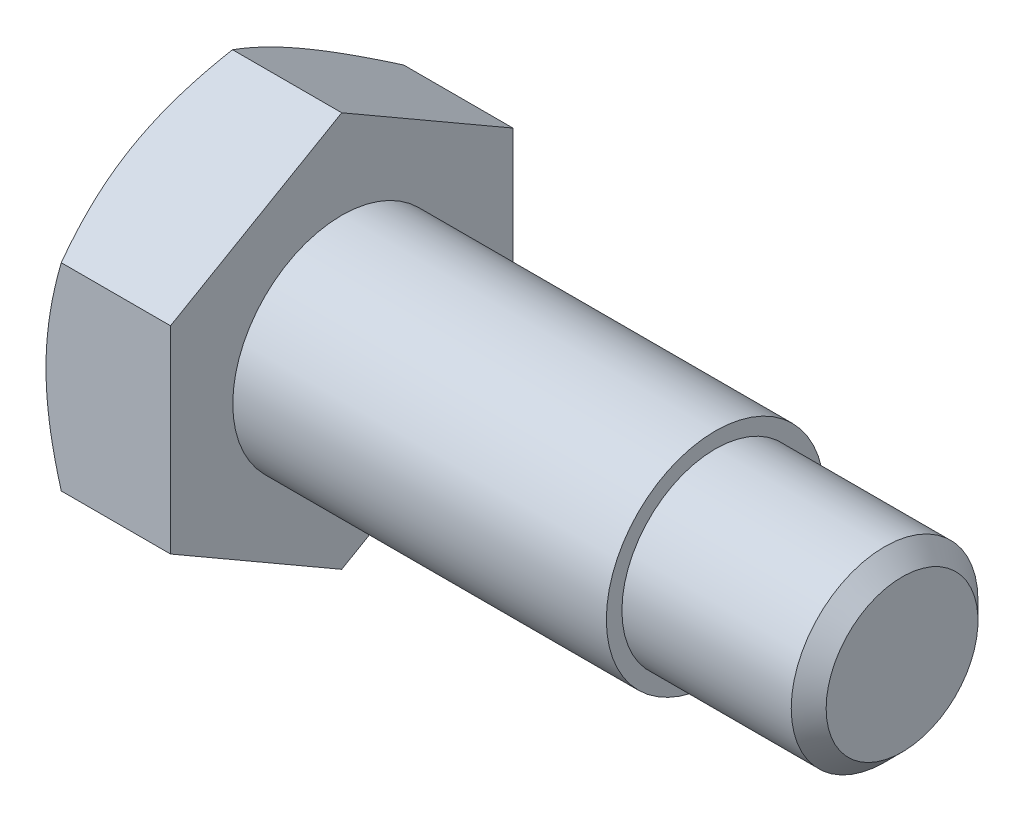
ISO-10303-21;
HEADER;
FILE_DESCRIPTION(('STEP AP214'),'2;1');
FILE_NAME('part.step','',(''),(''),'','','');
FILE_SCHEMA(('AUTOMOTIVE_DESIGN { 1 0 10303 214 1 1 1 1 }'));
ENDSEC;
DATA;
#1=APPLICATION_CONTEXT('core data for automotive mechanical design processes');
#2=APPLICATION_PROTOCOL_DEFINITION('international standard','automotive_design',2000,#1);
#3=PRODUCT_CONTEXT('',#1,'mechanical');
#4=PRODUCT('Part','Part','',(#3));
#5=PRODUCT_RELATED_PRODUCT_CATEGORY('part','',(#4));
#6=PRODUCT_DEFINITION_FORMATION('','',#4);
#7=PRODUCT_DEFINITION_CONTEXT('part definition',#1,'design');
#8=PRODUCT_DEFINITION('design','',#6,#7);
#9=PRODUCT_DEFINITION_SHAPE('','',#8);
#10=(LENGTH_UNIT() NAMED_UNIT(*) SI_UNIT(.MILLI.,.METRE.));
#11=(NAMED_UNIT(*) PLANE_ANGLE_UNIT() SI_UNIT($,.RADIAN.));
#12=(NAMED_UNIT(*) SI_UNIT($,.STERADIAN.) SOLID_ANGLE_UNIT());
#13=UNCERTAINTY_MEASURE_WITH_UNIT(LENGTH_MEASURE(1.E-05),#10,'distance_accuracy_value','');
#14=(GEOMETRIC_REPRESENTATION_CONTEXT(3) GLOBAL_UNCERTAINTY_ASSIGNED_CONTEXT((#13)) GLOBAL_UNIT_ASSIGNED_CONTEXT((#10,
#11,#12)) REPRESENTATION_CONTEXT('',''));
#15=CARTESIAN_POINT('',(0.,0.,0.));
#16=DIRECTION('',(0.,0.,1.));
#17=DIRECTION('',(1.,0.,0.));
#18=AXIS2_PLACEMENT_3D('',#15,#16,#17);
#19=CARTESIAN_POINT('',(2.,3.17542648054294,0.));
#20=DIRECTION('',(1.,0.,0.));
#21=DIRECTION('',(0.,0.,-1.));
#22=AXIS2_PLACEMENT_3D('',#19,#20,#21);
#23=PLANE('',#22);
#24=DIRECTION('',(0.,0.500000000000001,0.866025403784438));
#25=VECTOR('',#24,1.);
#26=CARTESIAN_POINT('',(2.,1.58771324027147,-2.75));
#27=LINE('',#26,#25);
#28=CARTESIAN_POINT('',(2.,1.58771324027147,-2.75));
#29=VERTEX_POINT('',#28);
#30=CARTESIAN_POINT('',(2.,3.17542648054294,0.));
#31=VERTEX_POINT('',#30);
#32=EDGE_CURVE('E235',#29,#31,#27,.T.);
#33=ORIENTED_EDGE('',*,*,#32,.T.);
#34=DIRECTION('',(0.,-0.500000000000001,0.866025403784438));
#35=VECTOR('',#34,1.);
#36=CARTESIAN_POINT('',(2.,3.17542648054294,0.));
#37=LINE('',#36,#35);
#38=CARTESIAN_POINT('',(2.,1.58771324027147,2.75));
#39=VERTEX_POINT('',#38);
#40=EDGE_CURVE('E233',#31,#39,#37,.T.);
#41=ORIENTED_EDGE('',*,*,#40,.T.);
#42=DIRECTION('',(0.,-1.,0.));
#43=VECTOR('',#42,1.);
#44=CARTESIAN_POINT('',(2.,1.58771324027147,2.75));
#45=LINE('',#44,#43);
#46=CARTESIAN_POINT('',(2.,-1.58771324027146,2.75));
#47=VERTEX_POINT('',#46);
#48=EDGE_CURVE('E229',#39,#47,#45,.T.);
#49=ORIENTED_EDGE('',*,*,#48,.T.);
#50=DIRECTION('',(0.,-0.500000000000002,-0.866025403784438));
#51=VECTOR('',#50,1.);
#52=CARTESIAN_POINT('',(2.,-3.17542648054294,0.));
#53=LINE('',#52,#51);
#54=CARTESIAN_POINT('',(2.,-3.17542648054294,0.));
#55=VERTEX_POINT('',#54);
#56=EDGE_CURVE('E227',#47,#55,#53,.T.);
#57=ORIENTED_EDGE('',*,*,#56,.T.);
#58=DIRECTION('',(0.,0.499999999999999,-0.866025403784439));
#59=VECTOR('',#58,1.);
#60=CARTESIAN_POINT('',(2.,-1.58771324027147,-2.75));
#61=LINE('',#60,#59);
#62=CARTESIAN_POINT('',(2.,-1.58771324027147,-2.75));
#63=VERTEX_POINT('',#62);
#64=EDGE_CURVE('E225',#55,#63,#61,.T.);
#65=ORIENTED_EDGE('',*,*,#64,.T.);
#66=DIRECTION('',(0.,1.,0.));
#67=VECTOR('',#66,1.);
#68=CARTESIAN_POINT('',(2.,1.58771324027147,-2.75));
#69=LINE('',#68,#67);
#70=EDGE_CURVE('E132',#63,#29,#69,.T.);
#71=ORIENTED_EDGE('',*,*,#70,.T.);
#72=EDGE_LOOP('',(#33,#41,#49,#57,#65,#71));
#73=FACE_BOUND('',#72,.T.);
#74=CARTESIAN_POINT('',(2.,0.,0.));
#75=DIRECTION('',(1.,0.,0.));
#76=DIRECTION('',(0.,0.,-1.));
#77=AXIS2_PLACEMENT_3D('',#74,#75,#76);
#78=CIRCLE('',#77,1.75);
#79=CARTESIAN_POINT('',(2.,0.,-1.75));
#80=VERTEX_POINT('',#79);
#81=EDGE_CURVE('E407',#80,#80,#78,.T.);
#82=ORIENTED_EDGE('',*,*,#81,.F.);
#83=EDGE_LOOP('',(#82));
#84=FACE_BOUND('',#83,.T.);
#85=ADVANCED_FACE('F32',(#73,#84),#23,.T.);
#86=CARTESIAN_POINT('',(2.,1.58771324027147,-2.75));
#87=DIRECTION('',(0.,-0.866025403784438,0.500000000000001));
#88=DIRECTION('',(0.,-0.500000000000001,-0.866025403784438));
#89=AXIS2_PLACEMENT_3D('',#86,#87,#88);
#90=PLANE('',#89);
#91=CARTESIAN_POINT('',(0.245686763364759,3.17554195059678,0.0002));
#92=CARTESIAN_POINT('',(0.205387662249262,3.10576962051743,-0.120649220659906));
#93=CARTESIAN_POINT('',(0.168736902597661,3.03539502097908,-0.242541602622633));
#94=CARTESIAN_POINT('',(0.104762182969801,2.89342717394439,-0.488437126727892));
#95=CARTESIAN_POINT('',(0.0774608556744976,2.82183140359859,-0.612444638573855));
#96=CARTESIAN_POINT('',(0.0349617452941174,2.67952717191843,-0.858922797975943));
#97=CARTESIAN_POINT('',(0.0194811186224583,2.60884060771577,-0.981355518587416));
#98=CARTESIAN_POINT('',(0.000999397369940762,2.46713482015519,-1.22679714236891));
#99=CARTESIAN_POINT('',(-0.00201700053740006,2.39611611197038,-1.34980515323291));
#100=CARTESIAN_POINT('',(0.00425314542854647,2.26341005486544,-1.57965878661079));
#101=CARTESIAN_POINT('',(0.0120001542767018,2.20170285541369,-1.68653879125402));
#102=CARTESIAN_POINT('',(0.0365551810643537,2.07869048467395,-1.89960246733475));
#103=CARTESIAN_POINT('',(0.0533715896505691,2.01738573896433,-2.00578540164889));
#104=CARTESIAN_POINT('',(0.0954119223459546,1.89411967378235,-2.21928848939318));
#105=CARTESIAN_POINT('',(0.120814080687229,1.83217395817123,-2.32658161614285));
#106=CARTESIAN_POINT('',(0.178467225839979,1.70920651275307,-2.53956747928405));
#107=CARTESIAN_POINT('',(0.210704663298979,1.64818320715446,-2.64526294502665));
#108=CARTESIAN_POINT('',(0.245686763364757,1.58759777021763,-2.7502));
#109=B_SPLINE_CURVE_WITH_KNOTS('',3,(#91,#92,#93,#94,#95,#96,#97,#98,#99,#100,#101,#102,#103,
#104,#105,#106,#107,#108),.UNSPECIFIED.,.F.,.F.,(4,2,2,2,2,2,2,2,4),(0.,0.435912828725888,
0.872873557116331,1.29901931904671,1.72464171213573,2.09526089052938,2.46622354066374,
2.84541551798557,3.22386274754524),.UNSPECIFIED.);
#110=CARTESIAN_POINT('',(0.245620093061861,3.17542648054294,0.));
#111=VERTEX_POINT('',#110);
#112=CARTESIAN_POINT('',(0.,2.3815698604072,-1.375));
#113=VERTEX_POINT('',#112);
#114=EDGE_CURVE('E50',#111,#113,#109,.T.);
#115=ORIENTED_EDGE('',*,*,#114,.F.);
#116=DIRECTION('',(-1.,0.,0.));
#117=VECTOR('',#116,1.);
#118=CARTESIAN_POINT('',(2.,3.17542648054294,0.));
#119=LINE('',#118,#117);
#120=EDGE_CURVE('E147',#31,#111,#119,.T.);
#121=ORIENTED_EDGE('',*,*,#120,.F.);
#122=ORIENTED_EDGE('',*,*,#32,.F.);
#123=DIRECTION('',(-1.,0.,0.));
#124=VECTOR('',#123,1.);
#125=CARTESIAN_POINT('',(2.,1.58771324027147,-2.75));
#126=LINE('',#125,#124);
#127=CARTESIAN_POINT('',(0.245620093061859,1.58771324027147,-2.75));
#128=VERTEX_POINT('',#127);
#129=EDGE_CURVE('E134',#29,#128,#126,.T.);
#130=ORIENTED_EDGE('',*,*,#129,.T.);
#131=EDGE_CURVE('E128',#113,#128,#109,.T.);
#132=ORIENTED_EDGE('',*,*,#131,.F.);
#133=EDGE_LOOP('',(#115,#121,#122,#130,#132));
#134=FACE_BOUND('',#133,.T.);
#135=ADVANCED_FACE('F34',(#134),#90,.F.);
#136=CARTESIAN_POINT('',(2.,3.17542648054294,0.));
#137=DIRECTION('',(0.,-0.866025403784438,-0.500000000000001));
#138=DIRECTION('',(0.,0.500000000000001,-0.866025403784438));
#139=AXIS2_PLACEMENT_3D('',#136,#137,#138);
#140=PLANE('',#139);
#141=CARTESIAN_POINT('',(0.245686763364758,1.58759777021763,2.7502));
#142=CARTESIAN_POINT('',(0.205387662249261,1.65737010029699,2.62935077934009));
#143=CARTESIAN_POINT('',(0.16873690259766,1.72774469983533,2.50745839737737));
#144=CARTESIAN_POINT('',(0.1047621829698,1.86971254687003,2.26156287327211));
#145=CARTESIAN_POINT('',(0.077460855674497,1.94130831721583,2.13755536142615));
#146=CARTESIAN_POINT('',(0.0349617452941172,2.08361254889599,1.89107720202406));
#147=CARTESIAN_POINT('',(0.0194811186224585,2.15429911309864,1.76864448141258));
#148=CARTESIAN_POINT('',(0.000999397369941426,2.29600490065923,1.52320285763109));
#149=CARTESIAN_POINT('',(-0.00201700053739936,2.36702360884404,1.40019484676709));
#150=CARTESIAN_POINT('',(0.00425314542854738,2.49972966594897,1.17034121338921));
#151=CARTESIAN_POINT('',(0.0120001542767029,2.56143686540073,1.06346120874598));
#152=CARTESIAN_POINT('',(0.0365551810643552,2.68444923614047,0.850397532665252));
#153=CARTESIAN_POINT('',(0.0533715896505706,2.74575398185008,0.744214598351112));
#154=CARTESIAN_POINT('',(0.0954119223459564,2.86902004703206,0.530711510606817));
#155=CARTESIAN_POINT('',(0.120814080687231,2.93096576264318,0.423418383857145));
#156=CARTESIAN_POINT('',(0.178467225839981,3.05393320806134,0.210432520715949));
#157=CARTESIAN_POINT('',(0.210704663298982,3.11495651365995,0.104737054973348));
#158=CARTESIAN_POINT('',(0.245686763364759,3.17554195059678,-0.000199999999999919));
#159=B_SPLINE_CURVE_WITH_KNOTS('',3,(#141,#142,#143,#144,#145,#146,#147,#148,#149,#150,#151,
#152,#153,#154,#155,#156,#157,#158),.UNSPECIFIED.,.F.,.F.,(4,2,2,2,2,2,2,2,4),(0.,
0.435912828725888,0.872873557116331,1.29901931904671,1.72464171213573,2.09526089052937,
2.46622354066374,2.84541551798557,3.22386274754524),.UNSPECIFIED.);
#160=CARTESIAN_POINT('',(0.24562009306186,1.58771324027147,2.75));
#161=VERTEX_POINT('',#160);
#162=CARTESIAN_POINT('',(0.,2.3815698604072,1.375));
#163=VERTEX_POINT('',#162);
#164=EDGE_CURVE('E57',#161,#163,#159,.T.);
#165=ORIENTED_EDGE('',*,*,#164,.F.);
#166=DIRECTION('',(-1.,0.,0.));
#167=VECTOR('',#166,1.);
#168=CARTESIAN_POINT('',(2.,1.58771324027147,2.75));
#169=LINE('',#168,#167);
#170=EDGE_CURVE('E144',#39,#161,#169,.T.);
#171=ORIENTED_EDGE('',*,*,#170,.F.);
#172=ORIENTED_EDGE('',*,*,#40,.F.);
#173=ORIENTED_EDGE('',*,*,#120,.T.);
#174=EDGE_CURVE('E160',#163,#111,#159,.T.);
#175=ORIENTED_EDGE('',*,*,#174,.F.);
#176=EDGE_LOOP('',(#165,#171,#172,#173,#175));
#177=FACE_BOUND('',#176,.T.);
#178=ADVANCED_FACE('F167',(#177),#140,.F.);
#179=CARTESIAN_POINT('',(2.,1.58771324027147,2.75));
#180=DIRECTION('',(0.,0.,-1.));
#181=DIRECTION('',(0.,1.,0.));
#182=AXIS2_PLACEMENT_3D('',#179,#180,#181);
#183=PLANE('',#182);
#184=CARTESIAN_POINT('',(1.36715210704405,-4.31638594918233,2.75));
#185=CARTESIAN_POINT('',(1.30845994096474,-4.19581737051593,2.75));
#186=CARTESIAN_POINT('',(1.25031586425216,-4.07497746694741,2.75));
#187=CARTESIAN_POINT('',(1.13543119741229,-3.83261088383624,2.75));
#188=CARTESIAN_POINT('',(1.07869081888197,-3.71108410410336,2.75));
#189=CARTESIAN_POINT('',(0.966646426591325,-3.46659808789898,2.75));
#190=CARTESIAN_POINT('',(0.91135147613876,-3.34363468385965,2.75));
#191=CARTESIAN_POINT('',(0.802956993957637,-3.09674757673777,2.75));
#192=CARTESIAN_POINT('',(0.749857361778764,-2.97282391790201,2.75));
#193=CARTESIAN_POINT('',(0.644703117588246,-2.71965806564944,2.75));
#194=CARTESIAN_POINT('',(0.592742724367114,-2.59037652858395,2.75));
#195=CARTESIAN_POINT('',(0.492631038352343,-2.33032018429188,2.75));
#196=CARTESIAN_POINT('',(0.444480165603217,-2.19954521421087,2.75));
#197=CARTESIAN_POINT('',(0.353213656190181,-1.9365223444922,2.75));
#198=CARTESIAN_POINT('',(0.310088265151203,-1.80427786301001,2.75));
#199=CARTESIAN_POINT('',(0.230222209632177,-1.53789259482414,2.75));
#200=CARTESIAN_POINT('',(0.193479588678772,-1.40375240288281,2.75));
#201=CARTESIAN_POINT('',(0.128302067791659,-1.13423793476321,2.75));
#202=CARTESIAN_POINT('',(0.0998212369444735,-0.998874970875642,2.75));
#203=CARTESIAN_POINT('',(0.0527456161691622,-0.726413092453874,2.75));
#204=CARTESIAN_POINT('',(0.0341497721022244,-0.589314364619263,2.75));
#205=CARTESIAN_POINT('',(0.00856858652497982,-0.315877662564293,2.75));
#206=CARTESIAN_POINT('',(0.0014299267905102,-0.17955439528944,2.75));
#207=CARTESIAN_POINT('',(-0.00103867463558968,0.0932131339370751,2.75));
#208=CARTESIAN_POINT('',(0.0036315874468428,0.229657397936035,2.75));
#209=CARTESIAN_POINT('',(0.0211304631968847,0.459764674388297,2.75));
#210=CARTESIAN_POINT('',(0.0310050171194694,0.55366721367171,2.75));
#211=CARTESIAN_POINT('',(0.0557601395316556,0.740814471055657,2.75));
#212=CARTESIAN_POINT('',(0.0706413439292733,0.834059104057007,2.75));
#213=CARTESIAN_POINT('',(0.12201579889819,1.1126628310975,2.75));
#214=CARTESIAN_POINT('',(0.165231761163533,1.29679769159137,2.75));
#215=CARTESIAN_POINT('',(0.240559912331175,1.57226006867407,2.75));
#216=CARTESIAN_POINT('',(0.267790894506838,1.66500394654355,2.75));
#217=CARTESIAN_POINT('',(0.325176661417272,1.84959145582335,2.75));
#218=CARTESIAN_POINT('',(0.355331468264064,1.94143508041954,2.75));
#219=CARTESIAN_POINT('',(0.418073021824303,2.12425036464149,2.75));
#220=CARTESIAN_POINT('',(0.45065906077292,2.21522226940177,2.75));
#221=CARTESIAN_POINT('',(0.517870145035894,2.39640501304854,2.75));
#222=CARTESIAN_POINT('',(0.552495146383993,2.48661586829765,2.75));
#223=CARTESIAN_POINT('',(0.647111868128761,2.72631941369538,2.75));
#224=CARTESIAN_POINT('',(0.70861713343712,2.87521406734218,2.75));
#225=CARTESIAN_POINT('',(0.835163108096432,3.17149877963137,2.75));
#226=CARTESIAN_POINT('',(0.900204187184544,3.3188886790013,2.75));
#227=CARTESIAN_POINT('',(1.03299372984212,3.61249860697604,2.75));
#228=CARTESIAN_POINT('',(1.1007430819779,3.75871823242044,2.75));
#229=CARTESIAN_POINT('',(1.23832197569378,4.05017738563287,2.75));
#230=CARTESIAN_POINT('',(1.30815157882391,4.19541688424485,2.75));
#231=CARTESIAN_POINT('',(1.52027220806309,4.63039070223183,2.75));
#232=CARTESIAN_POINT('',(1.66499194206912,4.91893915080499,2.75));
#233=CARTESIAN_POINT('',(1.95851426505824,5.49386340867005,2.75));
#234=CARTESIAN_POINT('',(2.10731603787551,5.78023963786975,2.75));
#235=CARTESIAN_POINT('',(2.39216757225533,6.32194576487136,2.75));
#236=CARTESIAN_POINT('',(2.52794261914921,6.57742037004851,2.75));
#237=CARTESIAN_POINT('',(2.8011424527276,7.08750371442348,2.75));
#238=CARTESIAN_POINT('',(2.93856733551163,7.34211240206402,2.75));
#239=CARTESIAN_POINT('',(3.21419429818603,7.84983547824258,2.75));
#240=CARTESIAN_POINT('',(3.352392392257,8.10295203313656,2.75));
#241=CARTESIAN_POINT('',(3.62973059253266,8.60864374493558,2.75));
#242=CARTESIAN_POINT('',(3.76887062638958,8.86121894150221,2.75));
#243=CARTESIAN_POINT('',(3.90835389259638,9.11360311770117,2.75));
#244=B_SPLINE_CURVE_WITH_KNOTS('',3,(#184,#185,#186,#187,#188,#189,#190,#191,#192,#193,#194,
#195,#196,#197,#198,#199,#200,#201,#202,#203,#204,#205,#206,#207,#208,#209,#210,#211,#212,#213,
#214,#215,#216,#217,#218,#219,#220,#221,#222,#223,#224,#225,#226,#227,#228,#229,#230,#231,#232,
#233,#234,#235,#236,#237,#238,#239,#240,#241,#242,#243),.UNSPECIFIED.,.F.,.F.,(4,2,2,2,2,2,2,2,
2,2,2,2,2,2,2,2,2,2,2,2,2,2,2,2,2,2,2,2,2,4),(0.,0.40229060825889,0.804641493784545,
1.20909649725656,1.61353297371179,2.03148461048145,2.44948226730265,2.86665458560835,
3.28369880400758,3.69837799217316,4.11301294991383,4.52205162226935,4.93109735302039,
5.21422195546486,5.49738253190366,6.06398562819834,6.35393648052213,6.6438895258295,
6.93375848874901,7.22362120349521,7.7068470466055,8.19012351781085,8.67355987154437,
9.15701054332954,10.1253686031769,11.0935344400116,11.9614658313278,12.8294480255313,
13.694604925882,14.5596961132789),.UNSPECIFIED.);
#245=CARTESIAN_POINT('',(0.245620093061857,-1.58771324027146,2.75));
#246=VERTEX_POINT('',#245);
#247=CARTESIAN_POINT('',(0.,0.,2.75));
#248=VERTEX_POINT('',#247);
#249=EDGE_CURVE('E242',#246,#248,#244,.T.);
#250=ORIENTED_EDGE('',*,*,#249,.F.);
#251=DIRECTION('',(-1.,0.,0.));
#252=VECTOR('',#251,1.);
#253=CARTESIAN_POINT('',(2.,-1.58771324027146,2.75));
#254=LINE('',#253,#252);
#255=EDGE_CURVE('E136',#47,#246,#254,.T.);
#256=ORIENTED_EDGE('',*,*,#255,.F.);
#257=ORIENTED_EDGE('',*,*,#48,.F.);
#258=ORIENTED_EDGE('',*,*,#170,.T.);
#259=EDGE_CURVE('E184',#248,#161,#244,.T.);
#260=ORIENTED_EDGE('',*,*,#259,.F.);
#261=EDGE_LOOP('',(#250,#256,#257,#258,#260));
#262=FACE_BOUND('',#261,.T.);
#263=ADVANCED_FACE('F248',(#262),#183,.F.);
#264=CARTESIAN_POINT('',(2.,-3.17542648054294,0.));
#265=DIRECTION('',(0.,0.866025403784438,-0.500000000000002));
#266=DIRECTION('',(0.,0.500000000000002,0.866025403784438));
#267=AXIS2_PLACEMENT_3D('',#264,#265,#266);
#268=PLANE('',#267);
#269=CARTESIAN_POINT('',(0.245686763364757,-3.17554195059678,-0.00020000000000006));
#270=CARTESIAN_POINT('',(0.20538766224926,-3.10576962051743,0.120649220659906));
#271=CARTESIAN_POINT('',(0.168736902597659,-3.03539502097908,0.242541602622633));
#272=CARTESIAN_POINT('',(0.104762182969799,-2.89342717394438,0.488437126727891));
#273=CARTESIAN_POINT('',(0.0774608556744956,-2.82183140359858,0.612444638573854));
#274=CARTESIAN_POINT('',(0.0349617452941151,-2.67952717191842,0.858922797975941));
#275=CARTESIAN_POINT('',(0.0194811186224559,-2.60884060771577,0.981355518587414));
#276=CARTESIAN_POINT('',(0.00099939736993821,-2.46713482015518,1.22679714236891));
#277=CARTESIAN_POINT('',(-0.00201700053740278,-2.39611611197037,1.34980515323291));
#278=CARTESIAN_POINT('',(0.00425314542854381,-2.26341005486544,1.57965878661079));
#279=CARTESIAN_POINT('',(0.0120001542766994,-2.20170285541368,1.68653879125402));
#280=CARTESIAN_POINT('',(0.0365551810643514,-2.07869048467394,1.89960246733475));
#281=CARTESIAN_POINT('',(0.0533715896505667,-2.01738573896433,2.00578540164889));
#282=CARTESIAN_POINT('',(0.0954119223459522,-1.89411967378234,2.21928848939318));
#283=CARTESIAN_POINT('',(0.120814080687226,-1.83217395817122,2.32658161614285));
#284=CARTESIAN_POINT('',(0.178467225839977,-1.70920651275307,2.53956747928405));
#285=CARTESIAN_POINT('',(0.210704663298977,-1.64818320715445,2.64526294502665));
#286=CARTESIAN_POINT('',(0.245686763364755,-1.58759777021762,2.7502));
#287=B_SPLINE_CURVE_WITH_KNOTS('',3,(#269,#270,#271,#272,#273,#274,#275,#276,#277,#278,#279,
#280,#281,#282,#283,#284,#285,#286),.UNSPECIFIED.,.F.,.F.,(4,2,2,2,2,2,2,2,4),(0.,
0.435912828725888,0.87287355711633,1.29901931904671,1.72464171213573,2.09526089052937,
2.46622354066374,2.84541551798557,3.22386274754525),.UNSPECIFIED.);
#288=CARTESIAN_POINT('',(0.245620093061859,-3.17542648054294,0.));
#289=VERTEX_POINT('',#288);
#290=CARTESIAN_POINT('',(0.,-2.3815698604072,1.375));
#291=VERTEX_POINT('',#290);
#292=EDGE_CURVE('E170',#289,#291,#287,.T.);
#293=ORIENTED_EDGE('',*,*,#292,.F.);
#294=DIRECTION('',(-1.,0.,0.));
#295=VECTOR('',#294,1.);
#296=CARTESIAN_POINT('',(2.,-3.17542648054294,0.));
#297=LINE('',#296,#295);
#298=EDGE_CURVE('E133',#55,#289,#297,.T.);
#299=ORIENTED_EDGE('',*,*,#298,.F.);
#300=ORIENTED_EDGE('',*,*,#56,.F.);
#301=ORIENTED_EDGE('',*,*,#255,.T.);
#302=EDGE_CURVE('E172',#291,#246,#287,.T.);
#303=ORIENTED_EDGE('',*,*,#302,.F.);
#304=EDGE_LOOP('',(#293,#299,#300,#301,#303));
#305=FACE_BOUND('',#304,.T.);
#306=ADVANCED_FACE('F223',(#305),#268,.F.);
#307=CARTESIAN_POINT('',(2.,-1.58771324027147,-2.75));
#308=DIRECTION('',(0.,0.866025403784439,0.499999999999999));
#309=DIRECTION('',(0.,-0.499999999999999,0.866025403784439));
#310=AXIS2_PLACEMENT_3D('',#307,#308,#309);
#311=PLANE('',#310);
#312=CARTESIAN_POINT('',(0.245686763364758,-1.58759777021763,-2.7502));
#313=CARTESIAN_POINT('',(0.205387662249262,-1.65737010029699,-2.62935077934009));
#314=CARTESIAN_POINT('',(0.168736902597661,-1.72774469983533,-2.50745839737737));
#315=CARTESIAN_POINT('',(0.1047621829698,-1.86971254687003,-2.26156287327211));
#316=CARTESIAN_POINT('',(0.0774608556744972,-1.94130831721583,-2.13755536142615));
#317=CARTESIAN_POINT('',(0.0349617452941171,-2.08361254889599,-1.89107720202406));
#318=CARTESIAN_POINT('',(0.0194811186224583,-2.15429911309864,-1.76864448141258));
#319=CARTESIAN_POINT('',(0.000999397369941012,-2.29600490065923,-1.52320285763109));
#320=CARTESIAN_POINT('',(-0.00201700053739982,-2.36702360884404,-1.40019484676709));
#321=CARTESIAN_POINT('',(0.00425314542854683,-2.49972966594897,-1.17034121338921));
#322=CARTESIAN_POINT('',(0.0120001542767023,-2.56143686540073,-1.06346120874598));
#323=CARTESIAN_POINT('',(0.0365551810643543,-2.68444923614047,-0.850397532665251));
#324=CARTESIAN_POINT('',(0.0533715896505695,-2.74575398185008,-0.744214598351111));
#325=CARTESIAN_POINT('',(0.0954119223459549,-2.86902004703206,-0.530711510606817));
#326=CARTESIAN_POINT('',(0.120814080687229,-2.93096576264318,-0.423418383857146));
#327=CARTESIAN_POINT('',(0.178467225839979,-3.05393320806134,-0.210432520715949));
#328=CARTESIAN_POINT('',(0.210704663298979,-3.11495651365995,-0.104737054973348));
#329=CARTESIAN_POINT('',(0.245686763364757,-3.17554195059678,0.000200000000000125));
#330=B_SPLINE_CURVE_WITH_KNOTS('',3,(#312,#313,#314,#315,#316,#317,#318,#319,#320,#321,#322,
#323,#324,#325,#326,#327,#328,#329),.UNSPECIFIED.,.F.,.F.,(4,2,2,2,2,2,2,2,4),(0.,
0.435912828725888,0.872873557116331,1.29901931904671,1.72464171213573,2.09526089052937,
2.46622354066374,2.84541551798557,3.22386274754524),.UNSPECIFIED.);
#331=CARTESIAN_POINT('',(0.245620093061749,-1.58771324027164,-2.75));
#332=VERTEX_POINT('',#331);
#333=CARTESIAN_POINT('',(0.,-2.38156986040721,-1.375));
#334=VERTEX_POINT('',#333);
#335=EDGE_CURVE('E110',#332,#334,#330,.T.);
#336=ORIENTED_EDGE('',*,*,#335,.F.);
#337=DIRECTION('',(-1.,0.,0.));
#338=VECTOR('',#337,1.);
#339=CARTESIAN_POINT('',(2.,-1.58771324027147,-2.75));
#340=LINE('',#339,#338);
#341=EDGE_CURVE('E124',#63,#332,#340,.T.);
#342=ORIENTED_EDGE('',*,*,#341,.F.);
#343=ORIENTED_EDGE('',*,*,#64,.F.);
#344=ORIENTED_EDGE('',*,*,#298,.T.);
#345=EDGE_CURVE('E127',#334,#289,#330,.T.);
#346=ORIENTED_EDGE('',*,*,#345,.F.);
#347=EDGE_LOOP('',(#336,#342,#343,#344,#346));
#348=FACE_BOUND('',#347,.T.);
#349=ADVANCED_FACE('F122',(#348),#311,.F.);
#350=CARTESIAN_POINT('',(2.,1.58771324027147,-2.75));
#351=DIRECTION('',(0.,0.,1.));
#352=DIRECTION('',(0.,-1.,0.));
#353=AXIS2_PLACEMENT_3D('',#350,#351,#352);
#354=PLANE('',#353);
#355=CARTESIAN_POINT('',(1.36715210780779,-4.31638595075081,-2.75));
#356=CARTESIAN_POINT('',(1.30845994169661,-4.19581737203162,-2.75));
#357=CARTESIAN_POINT('',(1.2503158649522,-4.07497746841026,-2.75));
#358=CARTESIAN_POINT('',(1.13543119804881,-3.83261088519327,-2.75));
#359=CARTESIAN_POINT('',(1.0786908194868,-3.7110841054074,-2.75));
#360=CARTESIAN_POINT('',(0.966646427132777,-3.46659808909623,-2.75));
#361=CARTESIAN_POINT('',(0.911351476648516,-3.3436346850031,-2.75));
#362=CARTESIAN_POINT('',(0.802956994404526,-3.09674757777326,-2.75));
#363=CARTESIAN_POINT('',(0.749857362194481,-2.97282391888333,-2.75));
#364=CARTESIAN_POINT('',(0.644703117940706,-2.71965806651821,-2.75));
#365=CARTESIAN_POINT('',(0.592742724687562,-2.59037652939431,-2.75));
#366=CARTESIAN_POINT('',(0.492631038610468,-2.33032018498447,-2.75));
#367=CARTESIAN_POINT('',(0.444480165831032,-2.19954521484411,-2.75));
#368=CARTESIAN_POINT('',(0.353213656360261,-1.93652234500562,-2.75));
#369=CARTESIAN_POINT('',(0.31008826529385,-1.80427786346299,-2.75));
#370=CARTESIAN_POINT('',(0.230222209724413,-1.53789259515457,-2.75));
#371=CARTESIAN_POINT('',(0.193479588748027,-1.40375240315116,-2.75));
#372=CARTESIAN_POINT('',(0.128302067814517,-1.13423793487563,-2.75));
#373=CARTESIAN_POINT('',(0.0998212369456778,-0.9988749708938,-2.75));
#374=CARTESIAN_POINT('',(0.0527456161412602,-0.726413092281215,-2.75));
#375=CARTESIAN_POINT('',(0.0341497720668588,-0.589314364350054,-2.75));
#376=CARTESIAN_POINT('',(0.00856858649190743,-0.31587766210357,-2.75));
#377=CARTESIAN_POINT('',(0.00142992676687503,-0.179554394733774,-2.75));
#378=CARTESIAN_POINT('',(-0.00103867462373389,0.093213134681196,-2.75));
#379=CARTESIAN_POINT('',(0.0036315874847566,0.229657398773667,-2.75));
#380=CARTESIAN_POINT('',(0.0211304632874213,0.459764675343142,-2.75));
#381=CARTESIAN_POINT('',(0.0310050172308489,0.553667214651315,-2.75));
#382=CARTESIAN_POINT('',(0.0557601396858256,0.740814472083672,-2.75));
#383=CARTESIAN_POINT('',(0.0706413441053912,0.83405910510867,-2.75));
#384=CARTESIAN_POINT('',(0.122015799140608,1.11266283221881,-2.75));
#385=CARTESIAN_POINT('',(0.165231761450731,1.29679769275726,-2.75));
#386=CARTESIAN_POINT('',(0.240559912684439,1.57226006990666,-2.75));
#387=CARTESIAN_POINT('',(0.267790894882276,1.66500394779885,-2.75));
#388=CARTESIAN_POINT('',(0.325176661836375,1.84959145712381,-2.75));
#389=CARTESIAN_POINT('',(0.355331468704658,1.94143508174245,-2.75));
#390=CARTESIAN_POINT('',(0.418073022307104,2.12425036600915,-2.75));
#391=CARTESIAN_POINT('',(0.450659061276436,2.21522227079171,-2.75));
#392=CARTESIAN_POINT('',(0.517870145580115,2.39640501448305,-2.75));
#393=CARTESIAN_POINT('',(0.552495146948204,2.48661586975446,-2.75));
#394=CARTESIAN_POINT('',(0.647111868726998,2.72631941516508,-2.75));
#395=CARTESIAN_POINT('',(0.708617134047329,2.87521406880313,-2.75));
#396=CARTESIAN_POINT('',(0.835163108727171,3.17149878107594,-2.75));
#397=CARTESIAN_POINT('',(0.90020418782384,3.31888868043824,-2.75));
#398=CARTESIAN_POINT('',(1.03299373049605,3.61249860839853,-2.75));
#399=CARTESIAN_POINT('',(1.10074308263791,3.75871823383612,-2.75));
#400=CARTESIAN_POINT('',(1.23832197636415,4.05017738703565,-2.75));
#401=CARTESIAN_POINT('',(1.30815157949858,4.19541688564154,-2.75));
#402=CARTESIAN_POINT('',(1.52027220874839,4.63039070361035,-2.75));
#403=CARTESIAN_POINT('',(1.6649919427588,4.91893915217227,-2.75));
#404=CARTESIAN_POINT('',(1.95851426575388,5.49386341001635,-2.75));
#405=CARTESIAN_POINT('',(2.10731603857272,5.78023963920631,-2.75));
#406=CARTESIAN_POINT('',(2.39216757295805,6.3219457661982,-2.75));
#407=CARTESIAN_POINT('',(2.52794261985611,6.57742037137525,-2.75));
#408=CARTESIAN_POINT('',(2.801142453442,7.08750371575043,-2.75));
#409=CARTESIAN_POINT('',(2.93856733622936,7.34211240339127,-2.75));
#410=CARTESIAN_POINT('',(3.21419429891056,7.84983547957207,-2.75));
#411=CARTESIAN_POINT('',(3.35239239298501,8.10295203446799,-2.75));
#412=CARTESIAN_POINT('',(3.62973059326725,8.60864374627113,-2.75));
#413=CARTESIAN_POINT('',(3.76887062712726,8.86121894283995,-2.75));
#414=CARTESIAN_POINT('',(3.90835389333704,9.11360311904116,-2.75));
#415=B_SPLINE_CURVE_WITH_KNOTS('',3,(#355,#356,#357,#358,#359,#360,#361,#362,#363,#364,#365,
#366,#367,#368,#369,#370,#371,#372,#373,#374,#375,#376,#377,#378,#379,#380,#381,#382,#383,#384,
#385,#386,#387,#388,#389,#390,#391,#392,#393,#394,#395,#396,#397,#398,#399,#400,#401,#402,#403,
#404,#405,#406,#407,#408,#409,#410,#411,#412,#413,#414),.UNSPECIFIED.,.F.,.F.,(4,2,2,2,2,2,2,2,
2,2,2,2,2,2,2,2,2,2,2,2,2,2,2,2,2,2,2,2,2,4),(0.,0.402290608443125,0.80464149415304,
1.20909649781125,1.61353297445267,2.03148461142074,2.44948226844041,2.86665458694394,
3.28369880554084,3.69837799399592,4.11301295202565,4.52205162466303,4.93109735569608,
5.21422195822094,5.49738253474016,6.06398563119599,6.35393648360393,6.64388952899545,
6.93375849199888,7.22362120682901,7.70684704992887,8.1901235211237,8.67355987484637,
9.15701054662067,10.1253686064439,11.0935344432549,11.9614658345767,12.8294480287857,
13.6946049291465,14.5596961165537),.UNSPECIFIED.);
#416=CARTESIAN_POINT('',(0.,0.,-2.75));
#417=VERTEX_POINT('',#416);
#418=EDGE_CURVE('E116',#128,#417,#415,.F.);
#419=ORIENTED_EDGE('',*,*,#418,.F.);
#420=ORIENTED_EDGE('',*,*,#129,.F.);
#421=ORIENTED_EDGE('',*,*,#70,.F.);
#422=ORIENTED_EDGE('',*,*,#341,.T.);
#423=EDGE_CURVE('E107',#417,#332,#415,.F.);
#424=ORIENTED_EDGE('',*,*,#423,.F.);
#425=EDGE_LOOP('',(#419,#420,#421,#422,#424));
#426=FACE_BOUND('',#425,.T.);
#427=ADVANCED_FACE('F130',(#426),#354,.F.);
#428=CARTESIAN_POINT('',(0.,0.,0.));
#429=DIRECTION('',(1.,0.,0.));
#430=DIRECTION('',(0.,0.,-1.));
#431=AXIS2_PLACEMENT_3D('',#428,#429,#430);
#432=CONICAL_SURFACE('',#431,2.75,1.0471975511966);
#433=ORIENTED_EDGE('',*,*,#335,.T.);
#434=CARTESIAN_POINT('',(0.,0.,0.));
#435=DIRECTION('',(1.,0.,0.));
#436=DIRECTION('',(0.,0.,-1.));
#437=AXIS2_PLACEMENT_3D('',#434,#435,#436);
#438=CIRCLE('',#437,2.75);
#439=EDGE_CURVE('E43',#334,#417,#438,.T.);
#440=ORIENTED_EDGE('',*,*,#439,.T.);
#441=ORIENTED_EDGE('',*,*,#423,.T.);
#442=EDGE_LOOP('',(#433,#440,#441));
#443=FACE_BOUND('',#442,.T.);
#444=ADVANCED_FACE('F109',(#443),#432,.T.);
#445=ORIENTED_EDGE('',*,*,#292,.T.);
#446=EDGE_CURVE('E149',#291,#334,#438,.T.);
#447=ORIENTED_EDGE('',*,*,#446,.T.);
#448=ORIENTED_EDGE('',*,*,#345,.T.);
#449=EDGE_LOOP('',(#445,#447,#448));
#450=FACE_BOUND('',#449,.T.);
#451=ADVANCED_FACE('F197',(#450),#432,.T.);
#452=ORIENTED_EDGE('',*,*,#249,.T.);
#453=EDGE_CURVE('E150',#248,#291,#438,.T.);
#454=ORIENTED_EDGE('',*,*,#453,.T.);
#455=ORIENTED_EDGE('',*,*,#302,.T.);
#456=EDGE_LOOP('',(#452,#454,#455));
#457=FACE_BOUND('',#456,.T.);
#458=ADVANCED_FACE('F191',(#457),#432,.T.);
#459=ORIENTED_EDGE('',*,*,#259,.T.);
#460=ORIENTED_EDGE('',*,*,#164,.T.);
#461=CARTESIAN_POINT('',(0.,0.,0.));
#462=DIRECTION('',(-1.,0.,0.));
#463=DIRECTION('',(0.,0.,1.));
#464=AXIS2_PLACEMENT_3D('',#461,#462,#463);
#465=CIRCLE('',#464,2.75);
#466=EDGE_CURVE('E117',#248,#163,#465,.T.);
#467=ORIENTED_EDGE('',*,*,#466,.F.);
#468=EDGE_LOOP('',(#459,#460,#467));
#469=FACE_BOUND('',#468,.T.);
#470=ADVANCED_FACE('F196',(#469),#432,.T.);
#471=ORIENTED_EDGE('',*,*,#174,.T.);
#472=ORIENTED_EDGE('',*,*,#114,.T.);
#473=EDGE_CURVE('E42',#113,#163,#438,.T.);
#474=ORIENTED_EDGE('',*,*,#473,.T.);
#475=EDGE_LOOP('',(#471,#472,#474));
#476=FACE_BOUND('',#475,.T.);
#477=ADVANCED_FACE('F158',(#476),#432,.T.);
#478=ORIENTED_EDGE('',*,*,#131,.T.);
#479=ORIENTED_EDGE('',*,*,#418,.T.);
#480=EDGE_CURVE('E12',#417,#113,#438,.T.);
#481=ORIENTED_EDGE('',*,*,#480,.T.);
#482=EDGE_LOOP('',(#478,#479,#481));
#483=FACE_BOUND('',#482,.T.);
#484=ADVANCED_FACE('F253',(#483),#432,.T.);
#485=CARTESIAN_POINT('',(0.,3.17542648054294,0.));
#486=DIRECTION('',(1.,0.,0.));
#487=DIRECTION('',(0.,0.,-1.));
#488=AXIS2_PLACEMENT_3D('',#485,#486,#487);
#489=PLANE('',#488);
#490=ORIENTED_EDGE('',*,*,#480,.F.);
#491=ORIENTED_EDGE('',*,*,#439,.F.);
#492=ORIENTED_EDGE('',*,*,#446,.F.);
#493=ORIENTED_EDGE('',*,*,#453,.F.);
#494=ORIENTED_EDGE('',*,*,#466,.T.);
#495=ORIENTED_EDGE('',*,*,#473,.F.);
#496=EDGE_LOOP('',(#490,#491,#492,#493,#494,#495));
#497=FACE_BOUND('',#496,.T.);
#498=ADVANCED_FACE('F163',(#497),#489,.F.);
#499=CARTESIAN_POINT('',(8.,0.,0.));
#500=DIRECTION('',(1.,0.,0.));
#501=DIRECTION('',(0.,0.,-1.));
#502=AXIS2_PLACEMENT_3D('',#499,#500,#501);
#503=PLANE('',#502);
#504=CARTESIAN_POINT('',(8.,0.,0.));
#505=DIRECTION('',(1.,0.,0.));
#506=DIRECTION('',(0.,0.,-1.));
#507=AXIS2_PLACEMENT_3D('',#504,#505,#506);
#508=CIRCLE('',#507,1.75);
#509=CARTESIAN_POINT('',(8.,0.,-1.75));
#510=VERTEX_POINT('',#509);
#511=EDGE_CURVE('E404',#510,#510,#508,.T.);
#512=ORIENTED_EDGE('',*,*,#511,.T.);
#513=EDGE_LOOP('',(#512));
#514=FACE_BOUND('',#513,.T.);
#515=CARTESIAN_POINT('',(8.,0.,0.));
#516=DIRECTION('',(1.,0.,0.));
#517=DIRECTION('',(0.,0.,-1.));
#518=AXIS2_PLACEMENT_3D('',#515,#516,#517);
#519=CIRCLE('',#518,1.5);
#520=CARTESIAN_POINT('',(8.,0.,-1.5));
#521=VERTEX_POINT('',#520);
#522=EDGE_CURVE('E37',#521,#521,#519,.T.);
#523=ORIENTED_EDGE('',*,*,#522,.F.);
#524=EDGE_LOOP('',(#523));
#525=FACE_BOUND('',#524,.T.);
#526=ADVANCED_FACE('F259',(#514,#525),#503,.T.);
#527=CARTESIAN_POINT('',(8.,0.,0.));
#528=DIRECTION('',(-1.,0.,0.));
#529=DIRECTION('',(0.,0.,1.));
#530=AXIS2_PLACEMENT_3D('',#527,#528,#529);
#531=CYLINDRICAL_SURFACE('',#530,1.75);
#532=ORIENTED_EDGE('',*,*,#511,.F.);
#533=EDGE_LOOP('',(#532));
#534=FACE_BOUND('',#533,.T.);
#535=ORIENTED_EDGE('',*,*,#81,.T.);
#536=EDGE_LOOP('',(#535));
#537=FACE_BOUND('',#536,.T.);
#538=ADVANCED_FACE('F198',(#534,#537),#531,.T.);
#539=CARTESIAN_POINT('',(11.,0.,0.));
#540=DIRECTION('',(-1.,0.,0.));
#541=DIRECTION('',(0.,0.,1.));
#542=AXIS2_PLACEMENT_3D('',#539,#540,#541);
#543=PLANE('',#542);
#544=CARTESIAN_POINT('',(11.,0.,0.));
#545=DIRECTION('',(-1.,0.,0.));
#546=DIRECTION('',(0.,0.,1.));
#547=AXIS2_PLACEMENT_3D('',#544,#545,#546);
#548=CIRCLE('',#547,1.2195);
#549=CARTESIAN_POINT('',(11.,0.,1.2195));
#550=VERTEX_POINT('',#549);
#551=EDGE_CURVE('E240',#550,#550,#548,.T.);
#552=ORIENTED_EDGE('',*,*,#551,.F.);
#553=EDGE_LOOP('',(#552));
#554=FACE_BOUND('',#553,.T.);
#555=ADVANCED_FACE('F200',(#554),#543,.F.);
#556=CARTESIAN_POINT('',(11.,0.,0.));
#557=DIRECTION('',(-1.,0.,0.));
#558=DIRECTION('',(0.,0.,1.));
#559=AXIS2_PLACEMENT_3D('',#556,#557,#558);
#560=CONICAL_SURFACE('',#559,1.2195,0.785398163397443);
#561=CARTESIAN_POINT('',(10.7195,0.,0.));
#562=DIRECTION('',(-1.,0.,0.));
#563=DIRECTION('',(0.,0.,1.));
#564=AXIS2_PLACEMENT_3D('',#561,#562,#563);
#565=CIRCLE('',#564,1.5);
#566=CARTESIAN_POINT('',(10.7195,0.,1.5));
#567=VERTEX_POINT('',#566);
#568=EDGE_CURVE('E238',#567,#567,#565,.T.);
#569=ORIENTED_EDGE('',*,*,#568,.F.);
#570=EDGE_LOOP('',(#569));
#571=FACE_BOUND('',#570,.T.);
#572=ORIENTED_EDGE('',*,*,#551,.T.);
#573=EDGE_LOOP('',(#572));
#574=FACE_BOUND('',#573,.T.);
#575=ADVANCED_FACE('F297',(#571,#574),#560,.T.);
#576=CARTESIAN_POINT('',(0.,0.,0.));
#577=DIRECTION('',(-1.,0.,0.));
#578=DIRECTION('',(0.,0.,1.));
#579=AXIS2_PLACEMENT_3D('',#576,#577,#578);
#580=CYLINDRICAL_SURFACE('',#579,1.5);
#581=ORIENTED_EDGE('',*,*,#522,.T.);
#582=EDGE_LOOP('',(#581));
#583=FACE_BOUND('',#582,.T.);
#584=ORIENTED_EDGE('',*,*,#568,.T.);
#585=EDGE_LOOP('',(#584));
#586=FACE_BOUND('',#585,.T.);
#587=ADVANCED_FACE('F269',(#583,#586),#580,.T.);
#588=CLOSED_SHELL('',(#85,#135,#178,#263,#306,#349,#427,#444,#451,#458,#470,#477,#484,#498,#526,
#538,#555,#575,#587));
#589=MANIFOLD_SOLID_BREP('B2',#588);
#590=ADVANCED_BREP_SHAPE_REPRESENTATION('',(#18,#589),#14);
#591=SHAPE_DEFINITION_REPRESENTATION(#9,#590);
ENDSEC;
END-ISO-10303-21;
